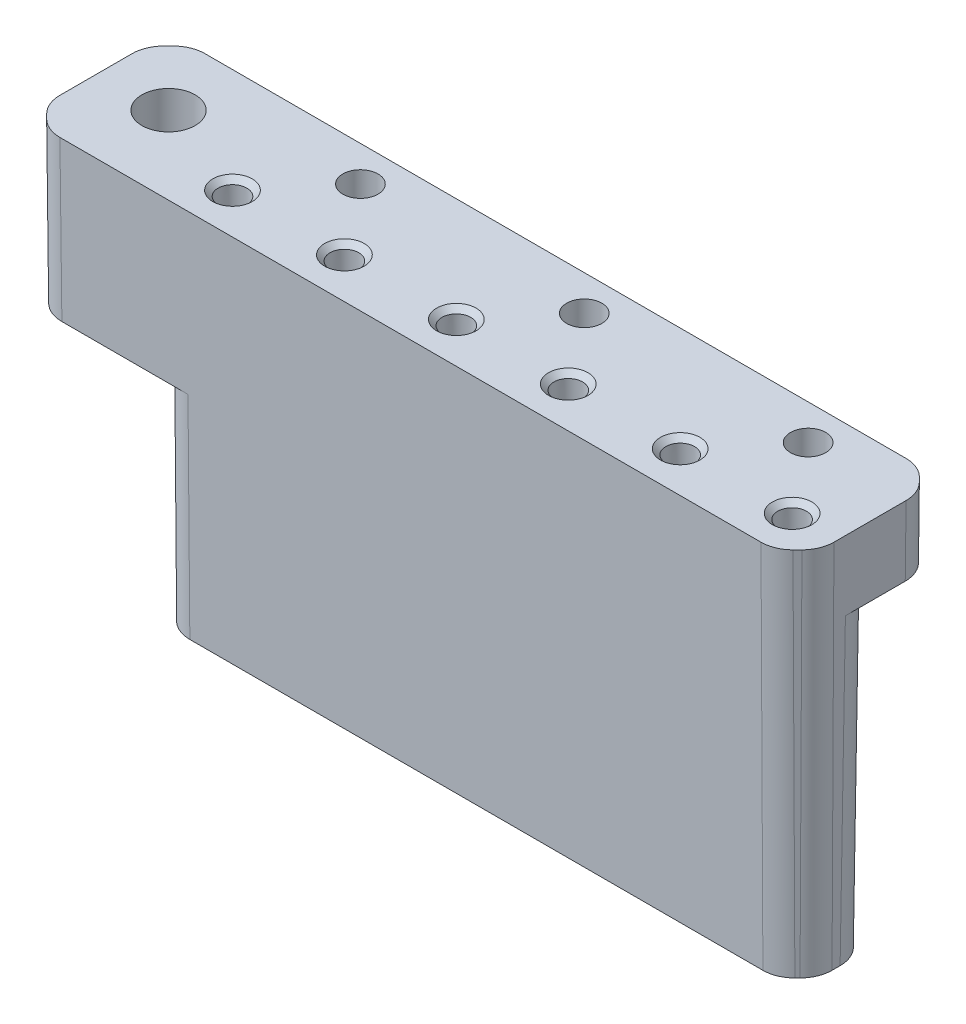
from build123d import *

# Parameters (mm, degrees)
ESQUISSE1_W                     = 72
ESQUISSE1_H                     = 35
EXTRUSION1_DEPTH                = 13
TROU_TARAUD_M63_D               = 5
TROU_TARAUD_M63_DEPTH           = 20
TROU_TARAUD_M63_TIP             = 1.502151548
R_P_TITION_LIN_AIRE1_COUNT      = 3
R_P_TITION_LIN_AIRE1_PITCH      = 21
R_P_TITION_LIN_AIRE2_COUNT      = 6
R_P_TITION_LIN_AIRE2_PITCH      = 10.5
R_P_TITION_LIN_AIRE4_COUNT      = 5
R_P_TITION_LIN_AIRE4_PITCH      = 10.5
DIAM_TRE_DU_PER_AGE_3_3_3_3_1_D = 3.3
R_P_TITION_LIN_AIRE5_COUNT      = 6
R_P_TITION_LIN_AIRE5_PITCH      = 10.5
CHANFREIN3_SIZE                 = 0.7
CHANFREIN3_SIZE2                = 1.212435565
CHANFREIN4_SIZE                 = 2
CHANFREIN6_SIZE                 = 0.2
CHANFREIN7_SIZE                 = 0.2
ESQUISSE26_W                    = 63.600572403
ESQUISSE26_H                    = 32.885106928
ENL_V_MAT_EXTRU_1_DEPTH         = 6
ESQUISSE29_W                    = 16.626781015
ESQUISSE29_H                    = 20
ENL_V_MAT_EXTRU_3_DEPTH         = 82.104870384
D_POUILLE1_ANGLE                = 0.5
CONG_1_R                        = 3


with BuildPart() as part:
    # Esquisse1 → Extrusion1 (new body)
    with BuildSketch(Plane.XY):
        with Locations((36, 17.5)):
            Rectangle(ESQUISSE1_W, ESQUISSE1_H)
    extrude(amount=EXTRUSION1_DEPTH)

    # Trou taraud_ M63
    with Locations(Plane(origin=(6, 35, 6), x_dir=(0, 0, 1), z_dir=(0, 1, 0))):
        with Locations((0, 0)):
            Hole(TROU_TARAUD_M63_D / 2, depth=TROU_TARAUD_M63_DEPTH)
            with Locations((0, 0, -(TROU_TARAUD_M63_DEPTH + TROU_TARAUD_M63_TIP / 2))):  # 118° drill point
                Cone(0, TROU_TARAUD_M63_D / 2, TROU_TARAUD_M63_TIP, mode=Mode.SUBTRACT)

    # Esquisse8 → Trou taraud_ M41 (revolve, cut)
    with BuildSketch(Plane(origin=(21, 35, 3), x_dir=(0, 0, 1), z_dir=(1, 0, 0))):
        Polygon((0, 0), (0, 16.491420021), (1.65, 15.5), (1.65, 0), align=None)
    trou_taraud_m41 = revolve(axis=Axis((21, 41.35, 3), (0, -1, 0)), mode=Mode.SUBTRACT)

    # R_p_tition lin_aire1: Trou taraud_ M41 ×3
    with Locations(*[(i * R_P_TITION_LIN_AIRE1_PITCH, 0, 0) for i in range(1, R_P_TITION_LIN_AIRE1_COUNT)]):
        add(trou_taraud_m41, mode=Mode.SUBTRACT)

    # Esquisse14 → Diam_tre du per_age _4.8 _4.8_2 (revolve, cut)
    with BuildSketch(Plane(origin=(68, 0, 9.5), x_dir=(0, 0, -1), z_dir=(1, 0, 0))):
        Polygon((0, 0), (0, 23.442065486), (2.4, 22), (2.4, 0), align=None)
    diam_tre_du_per_age_4_8_4_8_2 = revolve(axis=Axis((68, -6.35, 9.5), (0, 1, 0)), mode=Mode.SUBTRACT)

    # R_p_tition lin_aire2: Diam_tre du per_age _4.8 _4.8_2 ×6
    with Locations(*[(-i * R_P_TITION_LIN_AIRE2_PITCH, 0, 0) for i in range(1, R_P_TITION_LIN_AIRE2_COUNT)]):
        add(diam_tre_du_per_age_4_8_4_8_2, mode=Mode.SUBTRACT)

    # Esquisse20 → Diam_tre du per_age _1.5 _1.5_3 (revolve, cut)
    with BuildSketch(Plane(origin=(63, 0, 9), x_dir=(0, 0, -1), z_dir=(1, 0, 0))):
        Polygon((0, 0), (0, 10.450645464), (0.75, 10), (0.75, 0), align=None)
    diam_tre_du_per_age_1_5_1_5_3 = revolve(axis=Axis((63, -6.35, 9), (0, 1, 0)), mode=Mode.SUBTRACT)

    # R_p_tition lin_aire4: Diam_tre du per_age _1.5 _1.5_3 ×5
    with Locations(*[(-i * R_P_TITION_LIN_AIRE4_PITCH, 0, 0) for i in range(1, R_P_TITION_LIN_AIRE4_COUNT)]):
        add(diam_tre_du_per_age_1_5_1_5_3, mode=Mode.SUBTRACT)

    # Diam_tre du per_age _3.3 _3.3_1 (through all)
    with Locations(Plane(origin=(0, 35, 0), x_dir=(-1, 0, 0), z_dir=(0, 1, 0))):
        with Locations((-68, 9.5)):
            diam_tre_du_per_age_3_3_3_3_1 = Hole(DIAM_TRE_DU_PER_AGE_3_3_3_3_1_D / 2)

    # R_p_tition lin_aire5: Diam_tre du per_age _3.3 _3.3_1 ×6
    with Locations(*[(-i * R_P_TITION_LIN_AIRE5_PITCH, 0, 0) for i in range(1, R_P_TITION_LIN_AIRE5_COUNT)]):
        add(diam_tre_du_per_age_3_3_3_3_1, mode=Mode.SUBTRACT)

    # Chanfrein3
    chanfrein3_edges = [part.edges().sort_by_distance(p)[0] for p in [
        (63, 0, 9.75),
        (52.5, 0, 9.75),
        (42, 0, 9.75),
        (31.5, 0, 9.75),
        (21, 0, 9.75),
    ]]
    chanfrein3_side = [part.faces().sort_by_distance(p)[0] for p in [
        (35.172588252, 0, 6.075111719),
    ]]
    chamfer(chanfrein3_edges, length=CHANFREIN3_SIZE, length2=CHANFREIN3_SIZE2, reference=chanfrein3_side[0])

    # Chanfrein4
    chanfrein4_edges = [part.edges().sort_by_distance(p)[0] for p in [
        (72, 17.5, 13),
        (0, 17.5, 13),
        (72, 17.5, 0),
        (0, 17.5, 0),
    ]]
    chamfer(chanfrein4_edges, length=CHANFREIN4_SIZE)

    # Chanfrein6
    chanfrein6_edges = [part.edges().sort_by_distance(p)[0] for p in [
        (66.35, 35, 9.5),
        (55.85, 35, 9.5),
        (45.35, 35, 9.5),
        (34.85, 35, 9.5),
        (24.35, 35, 9.5),
        (13.85, 35, 9.5),
    ]]
    chamfer(chanfrein6_edges, length=CHANFREIN6_SIZE)

    # Chanfrein7
    chanfrein7_edges = [part.edges().sort_by_distance(p)[0] for p in [
        (68, 0, 11.9),
        (57.5, 0, 11.9),
        (47, 0, 11.9),
        (36.5, 0, 11.9),
        (26, 0, 11.9),
        (15.5, 0, 11.9),
    ]]
    chamfer(chanfrein7_edges, length=CHANFREIN7_SIZE)

    # Esquisse26 → Enl_v. mat.-Extru.1 (cut)
    with BuildSketch(Plane(origin=(0, 0, 0), x_dir=(-1, 0, 0), z_dir=(0, 0, -1))):
        with Locations((-41.800286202, 11.985325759)):
            Rectangle(ESQUISSE26_W, ESQUISSE26_H)
    extrude(amount=-ENL_V_MAT_EXTRU_1_DEPTH, mode=Mode.SUBTRACT)

    # Esquisse29 → Enl_v. mat.-Extru.3 (cut, through all)
    with BuildSketch(Plane(origin=(0, 0, 0), x_dir=(-1, 0, 0), z_dir=(0, 0, -1))):
        with Locations((-3.686609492, 10)):
            Rectangle(ESQUISSE29_W, ESQUISSE29_H)
    extrude(amount=-ENL_V_MAT_EXTRU_3_DEPTH, mode=Mode.SUBTRACT)

    # D_pouille1
    d_pouille1_faces = [part.faces().sort_by_distance(p)[0] for p in [
        (15.5, 11.1, 11.9),
        (26, 11.1, 11.9),
        (36.5, 11.1, 11.9),
        (47, 11.1, 11.9),
        (57.5, 11.1, 11.9),
        (72, 19.356355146, 7.912295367),
        (68, 11.1, 11.9),
        (66.35, 28.625322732, 9.5),
        (55.85, 28.625322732, 9.5),
        (45.35, 28.625322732, 9.5),
        (34.85, 28.625322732, 9.5),
        (24.35, 28.625322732, 9.5),
        (13.85, 28.625322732, 9.5),
        (1, 27.5, 12),
        (0, 27.5, 6.5),
        (1, 27.5, 1),
        (32.06730729, 30.730766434, 0),
        (10, 24.213939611, 3),
        (41.696650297, 14.311794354, 6),
        (71, 31.713939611, 1),
        (71, 17.5, 12),
        (38.660550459, 18.188073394, 13),
    ]]
    draft(d_pouille1_faces, Plane(origin=(0, 0, 13), x_dir=(0, 0, -1), z_dir=(0, -1, 0)), D_POUILLE1_ANGLE)

    # Cong_1
    cong_1_edges = [part.edges().sort_by_distance(p)[0] for p in [
        (-0.239988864, 27.5, 1.900593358),
        (70.114639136, 31.713939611, -0.276763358),
        (72.152720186, 17.5, 11.063258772),
        (1.900593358, 27.5, 13.239988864),
        (70.063258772, 17.5, 13.152720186),
        (72.276763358, 31.713939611, 1.885360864),
        (72.124043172, 14.213939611, 5.875956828),
        (12, 10, 5.912731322),
        (-0.239988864, 27.5, 11.099406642),
        (1.900593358, 27.5, -0.239988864),
        (12, 10, 13.087268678),
    ]]
    fillet(cong_1_edges, radius=CONG_1_R)


solid = part.part
